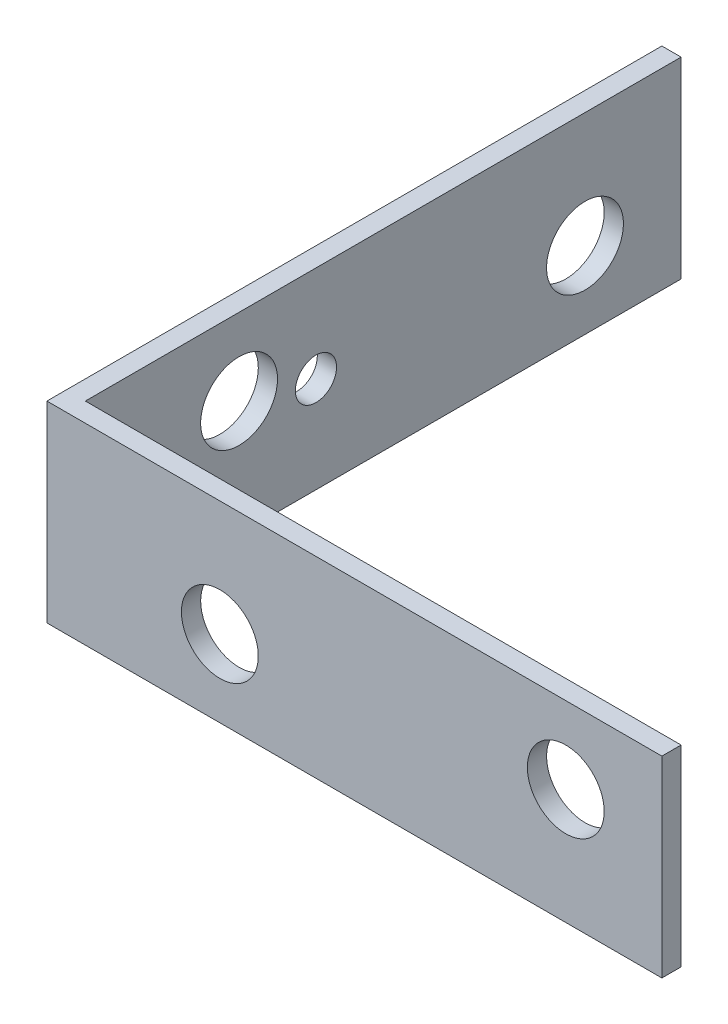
from build123d import *

# Parameters (mm, degrees)
EXTRUDE1_DEPTH = 15.875
SKETCH2_R      = 3.175
EXTRUDE2_DEPTH = 73.488107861
SKETCH3_R      = 3.175
EXTRUDE4_DEPTH = 73.488107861
SKETCH4_R      = 1.7
EXTRUDE5_DEPTH = 73.488107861


with BuildPart() as part:
    # Sketch1 → Extrude1 (new body)
    with BuildSketch(Plane(origin=(0, 0, 0), x_dir=(1, 0, 0), z_dir=(0, 1, 0))):
        Polygon((0, 0), (-50.8, 0), (-50.8, 50.8), (-49.2125, 50.8), (-49.2125, 1.5875), (0, 1.5875), align=None)
    extrude(amount=EXTRUDE1_DEPTH)

    # Sketch2 → Extrude2 (cut, through all)
    with BuildSketch(Plane(origin=(0, 0, -1.5875), x_dir=(-1, 0, 0), z_dir=(0, 0, -1))):
        with Locations((7.9375, 9.525)):
            Circle(SKETCH2_R)
        with Locations((36.5125, 6.35)):
            Circle(SKETCH2_R)
    extrude(amount=-EXTRUDE2_DEPTH, mode=Mode.SUBTRACT)

    # Sketch3 → Extrude4 (cut, through all)
    with BuildSketch(Plane(origin=(-49.2125, 0, 0), x_dir=(0, 0, -1), z_dir=(1, 0, 0))):
        with Locations((42.8625, 6.35)):
            Circle(SKETCH3_R)
        with Locations((14.2875, 9.525)):
            Circle(SKETCH3_R)
    extrude(amount=-EXTRUDE4_DEPTH, mode=Mode.SUBTRACT)

    # Sketch4 → Extrude5 (cut, through all)
    with BuildSketch(Plane(origin=(-49.2125, 0, 0), x_dir=(0, 0, -1), z_dir=(1, 0, 0))):
        with Locations((20.6375, 7.9375)):
            Circle(SKETCH4_R)
    extrude(amount=-EXTRUDE5_DEPTH, mode=Mode.SUBTRACT)


solid = part.part
